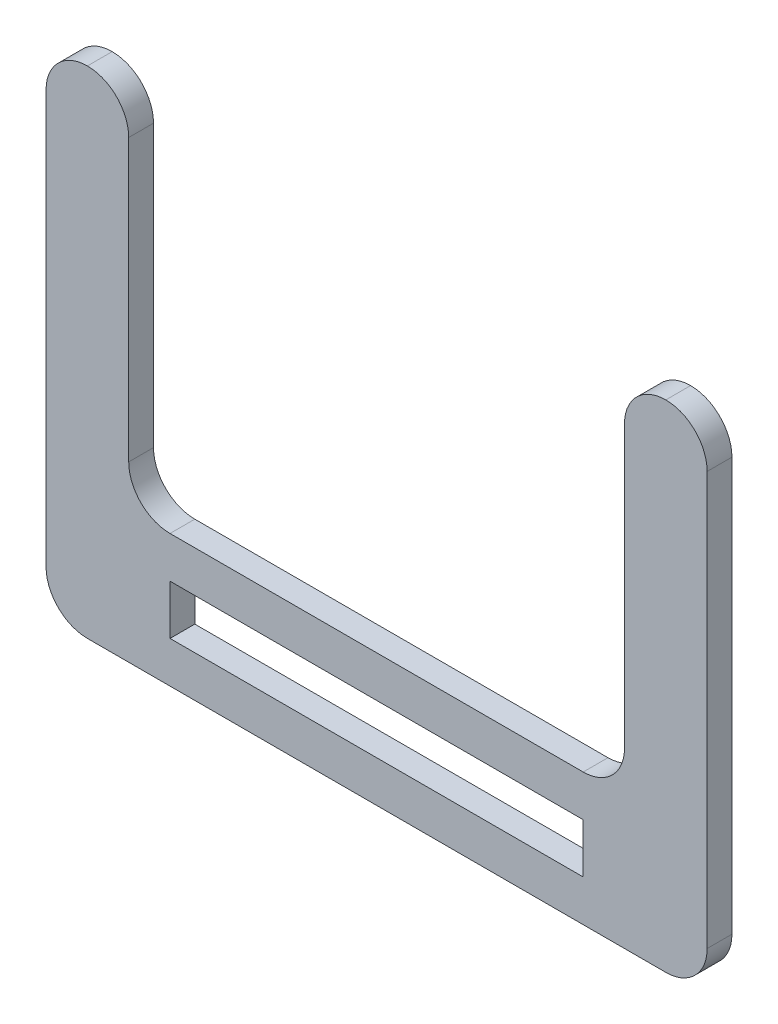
ISO-10303-21;
HEADER;
FILE_DESCRIPTION(('STEP AP214'),'2;1');
FILE_NAME('part.step','',(''),(''),'','','');
FILE_SCHEMA(('AUTOMOTIVE_DESIGN { 1 0 10303 214 1 1 1 1 }'));
ENDSEC;
DATA;
#1=APPLICATION_CONTEXT('core data for automotive mechanical design processes');
#2=APPLICATION_PROTOCOL_DEFINITION('international standard','automotive_design',2000,#1);
#3=PRODUCT_CONTEXT('',#1,'mechanical');
#4=PRODUCT('Part','Part','',(#3));
#5=PRODUCT_RELATED_PRODUCT_CATEGORY('part','',(#4));
#6=PRODUCT_DEFINITION_FORMATION('','',#4);
#7=PRODUCT_DEFINITION_CONTEXT('part definition',#1,'design');
#8=PRODUCT_DEFINITION('design','',#6,#7);
#9=PRODUCT_DEFINITION_SHAPE('','',#8);
#10=(LENGTH_UNIT() NAMED_UNIT(*) SI_UNIT(.MILLI.,.METRE.));
#11=(NAMED_UNIT(*) PLANE_ANGLE_UNIT() SI_UNIT($,.RADIAN.));
#12=(NAMED_UNIT(*) SI_UNIT($,.STERADIAN.) SOLID_ANGLE_UNIT());
#13=UNCERTAINTY_MEASURE_WITH_UNIT(LENGTH_MEASURE(1.E-05),#10,'distance_accuracy_value','');
#14=(GEOMETRIC_REPRESENTATION_CONTEXT(3) GLOBAL_UNCERTAINTY_ASSIGNED_CONTEXT((#13)) GLOBAL_UNIT_ASSIGNED_CONTEXT((#10,
#11,#12)) REPRESENTATION_CONTEXT('',''));
#15=CARTESIAN_POINT('',(0.,0.,0.));
#16=DIRECTION('',(0.,0.,1.));
#17=DIRECTION('',(1.,0.,0.));
#18=AXIS2_PLACEMENT_3D('',#15,#16,#17);
#19=CARTESIAN_POINT('',(-63.8455105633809,-4.50457746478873,2.99999999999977));
#20=DIRECTION('',(1.00000000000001,0.,0.));
#21=DIRECTION('',(0.,1.,0.));
#22=AXIS2_PLACEMENT_3D('',#19,#20,#21);
#23=PLANE('',#22);
#24=DIRECTION('',(0.,-1.,0.));
#25=VECTOR('',#24,1.);
#26=CARTESIAN_POINT('',(-63.8455105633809,-4.50457746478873,2.99999999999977));
#27=LINE('',#26,#25);
#28=CARTESIAN_POINT('',(-63.8455105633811,50.4954225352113,2.99999999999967));
#29=VERTEX_POINT('',#28);
#30=CARTESIAN_POINT('',(-63.8455105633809,0.495422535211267,2.99999999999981));
#31=VERTEX_POINT('',#30);
#32=EDGE_CURVE('E202',#29,#31,#27,.T.);
#33=ORIENTED_EDGE('',*,*,#32,.F.);
#34=DIRECTION('',(0.,0.,-1.00000000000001));
#35=VECTOR('',#34,1.);
#36=CARTESIAN_POINT('',(-63.8455105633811,50.4954225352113,2.99999999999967));
#37=LINE('',#36,#35);
#38=CARTESIAN_POINT('',(-63.8455105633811,50.4954225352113,-2.08166817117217E-13));
#39=VERTEX_POINT('',#38);
#40=EDGE_CURVE('E270',#29,#39,#37,.T.);
#41=ORIENTED_EDGE('',*,*,#40,.T.);
#42=DIRECTION('',(0.,-1.,0.));
#43=VECTOR('',#42,1.);
#44=CARTESIAN_POINT('',(-63.8455105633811,-4.50457746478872,-2.35922392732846E-13));
#45=LINE('',#44,#43);
#46=CARTESIAN_POINT('',(-63.8455105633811,0.495422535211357,0.));
#47=VERTEX_POINT('',#46);
#48=EDGE_CURVE('E182',#39,#47,#45,.T.);
#49=ORIENTED_EDGE('',*,*,#48,.T.);
#50=DIRECTION('',(0.,0.,-1.00000000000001));
#51=VECTOR('',#50,1.);
#52=CARTESIAN_POINT('',(-63.8455105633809,0.495422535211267,2.99999999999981));
#53=LINE('',#52,#51);
#54=EDGE_CURVE('E268',#47,#31,#53,.F.);
#55=ORIENTED_EDGE('',*,*,#54,.T.);
#56=EDGE_LOOP('',(#33,#41,#49,#55));
#57=FACE_BOUND('',#56,.T.);
#58=ADVANCED_FACE('F28',(#57),#23,.F.);
#59=CARTESIAN_POINT('',(-63.8455105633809,-4.50457746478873,2.99999999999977));
#60=DIRECTION('',(0.,1.,0.));
#61=DIRECTION('',(0.,0.,1.00000000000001));
#62=AXIS2_PLACEMENT_3D('',#59,#60,#61);
#63=PLANE('',#62);
#64=DIRECTION('',(1.00000000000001,0.,0.));
#65=VECTOR('',#64,1.);
#66=CARTESIAN_POINT('',(-63.8455105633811,-4.50457746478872,-2.35922392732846E-13));
#67=LINE('',#66,#65);
#68=CARTESIAN_POINT('',(-58.8455105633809,-4.50457746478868,-1.94289029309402E-13));
#69=VERTEX_POINT('',#68);
#70=CARTESIAN_POINT('',(11.1544894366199,-4.50457746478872,-1.66533453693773E-13));
#71=VERTEX_POINT('',#70);
#72=EDGE_CURVE('E187',#69,#71,#67,.T.);
#73=ORIENTED_EDGE('',*,*,#72,.T.);
#74=DIRECTION('',(0.,0.,-1.00000000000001));
#75=VECTOR('',#74,1.);
#76=CARTESIAN_POINT('',(11.1544894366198,-4.50457746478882,2.99999999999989));
#77=LINE('',#76,#75);
#78=CARTESIAN_POINT('',(11.1544894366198,-4.50457746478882,2.99999999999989));
#79=VERTEX_POINT('',#78);
#80=EDGE_CURVE('E275',#71,#79,#77,.F.);
#81=ORIENTED_EDGE('',*,*,#80,.T.);
#82=DIRECTION('',(1.00000000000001,0.,0.));
#83=VECTOR('',#82,1.);
#84=CARTESIAN_POINT('',(-63.8455105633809,-4.50457746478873,2.99999999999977));
#85=LINE('',#84,#83);
#86=CARTESIAN_POINT('',(-58.8455105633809,-4.50457746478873,2.9999999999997));
#87=VERTEX_POINT('',#86);
#88=EDGE_CURVE('E205',#87,#79,#85,.T.);
#89=ORIENTED_EDGE('',*,*,#88,.F.);
#90=DIRECTION('',(0.,0.,-1.00000000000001));
#91=VECTOR('',#90,1.);
#92=CARTESIAN_POINT('',(-58.8455105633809,-4.50457746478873,2.9999999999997));
#93=LINE('',#92,#91);
#94=EDGE_CURVE('E272',#87,#69,#93,.T.);
#95=ORIENTED_EDGE('',*,*,#94,.T.);
#96=EDGE_LOOP('',(#73,#81,#89,#95));
#97=FACE_BOUND('',#96,.T.);
#98=ADVANCED_FACE('F336',(#97),#63,.F.);
#99=CARTESIAN_POINT('',(16.1544894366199,55.4954225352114,2.99999999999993));
#100=DIRECTION('',(-1.00000000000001,0.,0.));
#101=DIRECTION('',(0.,-1.,0.));
#102=AXIS2_PLACEMENT_3D('',#99,#100,#101);
#103=PLANE('',#102);
#104=DIRECTION('',(0.,1.,0.));
#105=VECTOR('',#104,1.);
#106=CARTESIAN_POINT('',(16.1544894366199,55.4954225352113,0.));
#107=LINE('',#106,#105);
#108=CARTESIAN_POINT('',(16.15448943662,0.49542253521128,-1.2490009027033E-13));
#109=VERTEX_POINT('',#108);
#110=CARTESIAN_POINT('',(16.1544894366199,50.4954225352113,0.));
#111=VERTEX_POINT('',#110);
#112=EDGE_CURVE('E190',#109,#111,#107,.T.);
#113=ORIENTED_EDGE('',*,*,#112,.T.);
#114=DIRECTION('',(0.,0.,-1.00000000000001));
#115=VECTOR('',#114,1.);
#116=CARTESIAN_POINT('',(16.1544894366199,50.4954225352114,2.99999999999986));
#117=LINE('',#116,#115);
#118=CARTESIAN_POINT('',(16.1544894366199,50.4954225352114,2.99999999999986));
#119=VERTEX_POINT('',#118);
#120=EDGE_CURVE('E255',#111,#119,#117,.F.);
#121=ORIENTED_EDGE('',*,*,#120,.T.);
#122=DIRECTION('',(0.,1.,0.));
#123=VECTOR('',#122,1.);
#124=CARTESIAN_POINT('',(16.1544894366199,55.4954225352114,2.99999999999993));
#125=LINE('',#124,#123);
#126=CARTESIAN_POINT('',(16.15448943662,0.495422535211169,2.99999999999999));
#127=VERTEX_POINT('',#126);
#128=EDGE_CURVE('E208',#127,#119,#125,.T.);
#129=ORIENTED_EDGE('',*,*,#128,.F.);
#130=DIRECTION('',(0.,0.,-1.00000000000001));
#131=VECTOR('',#130,1.);
#132=CARTESIAN_POINT('',(16.15448943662,0.495422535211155,2.99999999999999));
#133=LINE('',#132,#131);
#134=EDGE_CURVE('E252',#127,#109,#133,.T.);
#135=ORIENTED_EDGE('',*,*,#134,.T.);
#136=EDGE_LOOP('',(#113,#121,#129,#135));
#137=FACE_BOUND('',#136,.T.);
#138=ADVANCED_FACE('F341',(#137),#103,.F.);
#139=CARTESIAN_POINT('',(6.15448943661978,11.4954225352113,2.99999999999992));
#140=DIRECTION('',(1.00000000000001,0.,0.));
#141=DIRECTION('',(0.,1.,0.));
#142=AXIS2_PLACEMENT_3D('',#139,#140,#141);
#143=PLANE('',#142);
#144=DIRECTION('',(0.,-1.,0.));
#145=VECTOR('',#144,1.);
#146=CARTESIAN_POINT('',(6.15448943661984,11.4954225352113,-2.35922392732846E-13));
#147=LINE('',#146,#145);
#148=CARTESIAN_POINT('',(6.15448943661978,50.4954225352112,-2.63677968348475E-13));
#149=VERTEX_POINT('',#148);
#150=CARTESIAN_POINT('',(6.15448943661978,16.4954225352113,-3.33066907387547E-13));
#151=VERTEX_POINT('',#150);
#152=EDGE_CURVE('E193',#149,#151,#147,.T.);
#153=ORIENTED_EDGE('',*,*,#152,.T.);
#154=DIRECTION('',(0.,0.,-1.00000000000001));
#155=VECTOR('',#154,1.);
#156=CARTESIAN_POINT('',(6.15448943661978,16.4954225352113,2.99999999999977));
#157=LINE('',#156,#155);
#158=CARTESIAN_POINT('',(6.15448943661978,16.4954225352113,2.99999999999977));
#159=VERTEX_POINT('',#158);
#160=EDGE_CURVE('E238',#151,#159,#157,.F.);
#161=ORIENTED_EDGE('',*,*,#160,.T.);
#162=DIRECTION('',(0.,-1.,0.));
#163=VECTOR('',#162,1.);
#164=CARTESIAN_POINT('',(6.15448943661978,11.4954225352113,2.99999999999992));
#165=LINE('',#164,#163);
#166=CARTESIAN_POINT('',(6.15448943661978,50.4954225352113,2.99999999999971));
#167=VERTEX_POINT('',#166);
#168=EDGE_CURVE('E210',#167,#159,#165,.T.);
#169=ORIENTED_EDGE('',*,*,#168,.F.);
#170=DIRECTION('',(0.,0.,-1.00000000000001));
#171=VECTOR('',#170,1.);
#172=CARTESIAN_POINT('',(6.15448943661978,50.4954225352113,2.99999999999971));
#173=LINE('',#172,#171);
#174=EDGE_CURVE('E236',#167,#149,#173,.T.);
#175=ORIENTED_EDGE('',*,*,#174,.T.);
#176=EDGE_LOOP('',(#153,#161,#169,#175));
#177=FACE_BOUND('',#176,.T.);
#178=ADVANCED_FACE('F289',(#177),#143,.F.);
#179=CARTESIAN_POINT('',(-53.8455105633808,11.4954225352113,2.99999999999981));
#180=DIRECTION('',(0.,-1.,0.));
#181=DIRECTION('',(1.00000000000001,0.,0.));
#182=AXIS2_PLACEMENT_3D('',#179,#180,#181);
#183=PLANE('',#182);
#184=DIRECTION('',(-1.00000000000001,0.,0.));
#185=VECTOR('',#184,1.);
#186=CARTESIAN_POINT('',(-53.8455105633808,11.4954225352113,-1.38777878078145E-13));
#187=LINE('',#186,#185);
#188=CARTESIAN_POINT('',(1.15448943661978,11.4954225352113,-2.08166817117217E-13));
#189=VERTEX_POINT('',#188);
#190=CARTESIAN_POINT('',(-48.8455105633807,11.4954225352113,-2.77555756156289E-13));
#191=VERTEX_POINT('',#190);
#192=EDGE_CURVE('E196',#189,#191,#187,.T.);
#193=ORIENTED_EDGE('',*,*,#192,.T.);
#194=DIRECTION('',(0.,0.,-1.00000000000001));
#195=VECTOR('',#194,1.);
#196=CARTESIAN_POINT('',(-48.8455105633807,11.4954225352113,2.99999999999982));
#197=LINE('',#196,#195);
#198=CARTESIAN_POINT('',(-48.8455105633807,11.4954225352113,2.99999999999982));
#199=VERTEX_POINT('',#198);
#200=EDGE_CURVE('E234',#191,#199,#197,.F.);
#201=ORIENTED_EDGE('',*,*,#200,.T.);
#202=DIRECTION('',(-1.00000000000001,0.,0.));
#203=VECTOR('',#202,1.);
#204=CARTESIAN_POINT('',(-53.8455105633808,11.4954225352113,2.99999999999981));
#205=LINE('',#204,#203);
#206=CARTESIAN_POINT('',(1.15448943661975,11.4954225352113,3.00000000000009));
#207=VERTEX_POINT('',#206);
#208=EDGE_CURVE('E213',#207,#199,#205,.T.);
#209=ORIENTED_EDGE('',*,*,#208,.F.);
#210=DIRECTION('',(0.,0.,-1.00000000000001));
#211=VECTOR('',#210,1.);
#212=CARTESIAN_POINT('',(1.15448943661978,11.4954225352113,-2.08166817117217E-13));
#213=LINE('',#212,#211);
#214=EDGE_CURVE('E231',#207,#189,#213,.T.);
#215=ORIENTED_EDGE('',*,*,#214,.T.);
#216=EDGE_LOOP('',(#193,#201,#209,#215));
#217=FACE_BOUND('',#216,.T.);
#218=ADVANCED_FACE('F297',(#217),#183,.F.);
#219=CARTESIAN_POINT('',(-53.8455105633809,55.4954225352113,2.99999999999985));
#220=DIRECTION('',(-1.00000000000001,0.,0.));
#221=DIRECTION('',(0.,-1.,0.));
#222=AXIS2_PLACEMENT_3D('',#219,#220,#221);
#223=PLANE('',#222);
#224=DIRECTION('',(0.,1.,0.));
#225=VECTOR('',#224,1.);
#226=CARTESIAN_POINT('',(-53.8455105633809,55.4954225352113,2.99999999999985));
#227=LINE('',#226,#225);
#228=CARTESIAN_POINT('',(-53.8455105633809,16.4954225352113,2.99999999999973));
#229=VERTEX_POINT('',#228);
#230=CARTESIAN_POINT('',(-53.8455105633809,50.4954225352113,2.99999999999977));
#231=VERTEX_POINT('',#230);
#232=EDGE_CURVE('E216',#229,#231,#227,.T.);
#233=ORIENTED_EDGE('',*,*,#232,.F.);
#234=DIRECTION('',(0.,0.,-1.00000000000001));
#235=VECTOR('',#234,1.);
#236=CARTESIAN_POINT('',(-53.8455105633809,16.4954225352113,-2.77555756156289E-13));
#237=LINE('',#236,#235);
#238=CARTESIAN_POINT('',(-53.8455105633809,16.4954225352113,-2.77555756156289E-13));
#239=VERTEX_POINT('',#238);
#240=EDGE_CURVE('E228',#229,#239,#237,.T.);
#241=ORIENTED_EDGE('',*,*,#240,.T.);
#242=DIRECTION('',(0.,1.,0.));
#243=VECTOR('',#242,1.);
#244=CARTESIAN_POINT('',(-53.845510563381,55.4954225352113,-1.80411241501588E-13));
#245=LINE('',#244,#243);
#246=CARTESIAN_POINT('',(-53.8455105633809,50.4954225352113,-3.19189119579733E-13));
#247=VERTEX_POINT('',#246);
#248=EDGE_CURVE('E199',#239,#247,#245,.T.);
#249=ORIENTED_EDGE('',*,*,#248,.T.);
#250=DIRECTION('',(0.,0.,-1.00000000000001));
#251=VECTOR('',#250,1.);
#252=CARTESIAN_POINT('',(-53.8455105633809,50.4954225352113,2.99999999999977));
#253=LINE('',#252,#251);
#254=EDGE_CURVE('E225',#247,#231,#253,.F.);
#255=ORIENTED_EDGE('',*,*,#254,.T.);
#256=EDGE_LOOP('',(#233,#241,#249,#255));
#257=FACE_BOUND('',#256,.T.);
#258=ADVANCED_FACE('F304',(#257),#223,.F.);
#259=CARTESIAN_POINT('',(-63.8455105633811,55.4954225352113,2.99999999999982));
#260=DIRECTION('',(0.,0.,-1.00000000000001));
#261=DIRECTION('',(-1.00000000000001,0.,0.));
#262=AXIS2_PLACEMENT_3D('',#259,#260,#261);
#263=PLANE('',#262);
#264=DIRECTION('',(1.00000000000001,0.,0.));
#265=VECTOR('',#264,1.);
#266=CARTESIAN_POINT('',(-48.8455105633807,0.495422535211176,2.99999999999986));
#267=LINE('',#266,#265);
#268=CARTESIAN_POINT('',(-48.8455105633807,0.495422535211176,2.99999999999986));
#269=VERTEX_POINT('',#268);
#270=CARTESIAN_POINT('',(1.1544894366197,0.495422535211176,3.00000000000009));
#271=VERTEX_POINT('',#270);
#272=EDGE_CURVE('E166',#269,#271,#267,.T.);
#273=ORIENTED_EDGE('',*,*,#272,.F.);
#274=DIRECTION('',(0.,-1.,0.));
#275=VECTOR('',#274,1.);
#276=CARTESIAN_POINT('',(-48.8455105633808,6.49542253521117,2.99999999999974));
#277=LINE('',#276,#275);
#278=CARTESIAN_POINT('',(-48.8455105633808,6.49542253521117,2.99999999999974));
#279=VERTEX_POINT('',#278);
#280=EDGE_CURVE('E171',#279,#269,#277,.T.);
#281=ORIENTED_EDGE('',*,*,#280,.F.);
#282=DIRECTION('',(-1.00000000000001,0.,0.));
#283=VECTOR('',#282,1.);
#284=CARTESIAN_POINT('',(-48.8455105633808,6.49542253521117,2.99999999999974));
#285=LINE('',#284,#283);
#286=CARTESIAN_POINT('',(1.15448943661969,6.49542253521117,2.99999999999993));
#287=VERTEX_POINT('',#286);
#288=EDGE_CURVE('E175',#287,#279,#285,.T.);
#289=ORIENTED_EDGE('',*,*,#288,.F.);
#290=DIRECTION('',(0.,1.,0.));
#291=VECTOR('',#290,1.);
#292=CARTESIAN_POINT('',(1.15448943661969,6.49542253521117,2.99999999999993));
#293=LINE('',#292,#291);
#294=EDGE_CURVE('E155',#271,#287,#293,.T.);
#295=ORIENTED_EDGE('',*,*,#294,.F.);
#296=EDGE_LOOP('',(#273,#281,#289,#295));
#297=FACE_BOUND('',#296,.T.);
#298=ORIENTED_EDGE('',*,*,#128,.T.);
#299=CARTESIAN_POINT('',(11.1544894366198,50.4954225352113,2.99999999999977));
#300=DIRECTION('',(0.,0.,-1.00000000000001));
#301=DIRECTION('',(-1.00000000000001,0.,0.));
#302=AXIS2_PLACEMENT_3D('',#299,#300,#301);
#303=CIRCLE('',#302,5.);
#304=CARTESIAN_POINT('',(11.1544894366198,55.4954225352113,2.99999999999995));
#305=VERTEX_POINT('',#304);
#306=EDGE_CURVE('E49',#119,#305,#303,.F.);
#307=ORIENTED_EDGE('',*,*,#306,.T.);
#308=CARTESIAN_POINT('',(11.1544894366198,50.4954225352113,2.99999999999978));
#309=DIRECTION('',(0.,0.,-1.00000000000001));
#310=DIRECTION('',(-1.00000000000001,0.,0.));
#311=AXIS2_PLACEMENT_3D('',#308,#309,#310);
#312=CIRCLE('',#311,5.);
#313=EDGE_CURVE('E265',#305,#167,#312,.F.);
#314=ORIENTED_EDGE('',*,*,#313,.T.);
#315=ORIENTED_EDGE('',*,*,#168,.T.);
#316=CARTESIAN_POINT('',(1.15448943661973,16.4954225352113,2.99999999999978));
#317=DIRECTION('',(0.,0.,-1.00000000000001));
#318=DIRECTION('',(-1.00000000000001,0.,0.));
#319=AXIS2_PLACEMENT_3D('',#316,#317,#318);
#320=CIRCLE('',#319,5.);
#321=EDGE_CURVE('E11',#159,#207,#320,.T.);
#322=ORIENTED_EDGE('',*,*,#321,.T.);
#323=ORIENTED_EDGE('',*,*,#208,.T.);
#324=CARTESIAN_POINT('',(-48.8455105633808,16.4954225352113,2.99999999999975));
#325=DIRECTION('',(0.,0.,-1.00000000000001));
#326=DIRECTION('',(-1.00000000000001,0.,0.));
#327=AXIS2_PLACEMENT_3D('',#324,#325,#326);
#328=CIRCLE('',#327,5.);
#329=EDGE_CURVE('E279',#199,#229,#328,.T.);
#330=ORIENTED_EDGE('',*,*,#329,.T.);
#331=ORIENTED_EDGE('',*,*,#232,.T.);
#332=CARTESIAN_POINT('',(-58.8455105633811,50.4954225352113,2.99999999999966));
#333=DIRECTION('',(0.,0.,-1.00000000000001));
#334=DIRECTION('',(-1.00000000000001,0.,0.));
#335=AXIS2_PLACEMENT_3D('',#332,#333,#334);
#336=CIRCLE('',#335,5.);
#337=CARTESIAN_POINT('',(-58.8455105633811,55.4954225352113,2.99999999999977));
#338=VERTEX_POINT('',#337);
#339=EDGE_CURVE('E42',#231,#338,#336,.F.);
#340=ORIENTED_EDGE('',*,*,#339,.T.);
#341=CARTESIAN_POINT('',(-58.8455105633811,50.4954225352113,2.99999999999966));
#342=DIRECTION('',(0.,0.,-1.00000000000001));
#343=DIRECTION('',(-1.00000000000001,0.,0.));
#344=AXIS2_PLACEMENT_3D('',#341,#342,#343);
#345=CIRCLE('',#344,5.);
#346=EDGE_CURVE('E262',#338,#29,#345,.F.);
#347=ORIENTED_EDGE('',*,*,#346,.T.);
#348=ORIENTED_EDGE('',*,*,#32,.T.);
#349=CARTESIAN_POINT('',(-58.845510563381,0.495422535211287,2.99999999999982));
#350=DIRECTION('',(0.,0.,-1.00000000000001));
#351=DIRECTION('',(-1.00000000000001,0.,0.));
#352=AXIS2_PLACEMENT_3D('',#349,#350,#351);
#353=CIRCLE('',#352,5.);
#354=EDGE_CURVE('E258',#31,#87,#353,.F.);
#355=ORIENTED_EDGE('',*,*,#354,.T.);
#356=ORIENTED_EDGE('',*,*,#88,.T.);
#357=CARTESIAN_POINT('',(11.1544894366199,0.495422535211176,3.00000000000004));
#358=DIRECTION('',(0.,0.,-1.00000000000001));
#359=DIRECTION('',(-1.00000000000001,0.,0.));
#360=AXIS2_PLACEMENT_3D('',#357,#358,#359);
#361=CIRCLE('',#360,5.);
#362=EDGE_CURVE('E260',#79,#127,#361,.F.);
#363=ORIENTED_EDGE('',*,*,#362,.T.);
#364=EDGE_LOOP('',(#298,#307,#314,#315,#322,#323,#330,#331,#340,#347,#348,#355,#356,#363));
#365=FACE_BOUND('',#364,.T.);
#366=ADVANCED_FACE('F173',(#297,#365),#263,.F.);
#367=CARTESIAN_POINT('',(-63.8455105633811,55.4954225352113,-1.52655665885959E-13));
#368=DIRECTION('',(0.,0.,-1.00000000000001));
#369=DIRECTION('',(-1.00000000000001,0.,0.));
#370=AXIS2_PLACEMENT_3D('',#367,#368,#369);
#371=PLANE('',#370);
#372=DIRECTION('',(0.,1.,0.));
#373=VECTOR('',#372,1.);
#374=CARTESIAN_POINT('',(-48.8455105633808,55.4954225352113,-3.88578058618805E-13));
#375=LINE('',#374,#373);
#376=CARTESIAN_POINT('',(-48.8455105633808,0.495422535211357,-1.94289029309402E-13));
#377=VERTEX_POINT('',#376);
#378=CARTESIAN_POINT('',(-48.8455105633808,6.49542253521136,-3.88578058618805E-13));
#379=VERTEX_POINT('',#378);
#380=EDGE_CURVE('E223',#377,#379,#375,.T.);
#381=ORIENTED_EDGE('',*,*,#380,.F.);
#382=DIRECTION('',(-1.00000000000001,0.,0.));
#383=VECTOR('',#382,1.);
#384=CARTESIAN_POINT('',(-63.8455105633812,0.495422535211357,0.));
#385=LINE('',#384,#383);
#386=CARTESIAN_POINT('',(1.15448943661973,0.495422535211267,-2.35922392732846E-13));
#387=VERTEX_POINT('',#386);
#388=EDGE_CURVE('E218',#387,#377,#385,.T.);
#389=ORIENTED_EDGE('',*,*,#388,.F.);
#390=DIRECTION('',(0.,-1.,0.));
#391=VECTOR('',#390,1.);
#392=CARTESIAN_POINT('',(1.15448943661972,55.4954225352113,0.));
#393=LINE('',#392,#391);
#394=CARTESIAN_POINT('',(1.15448943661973,6.49542253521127,-3.33066907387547E-13));
#395=VERTEX_POINT('',#394);
#396=EDGE_CURVE('E158',#395,#387,#393,.T.);
#397=ORIENTED_EDGE('',*,*,#396,.F.);
#398=DIRECTION('',(1.00000000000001,0.,0.));
#399=VECTOR('',#398,1.);
#400=CARTESIAN_POINT('',(-63.8455105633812,6.49542253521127,-2.35922392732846E-13));
#401=LINE('',#400,#399);
#402=EDGE_CURVE('E221',#379,#395,#401,.T.);
#403=ORIENTED_EDGE('',*,*,#402,.F.);
#404=EDGE_LOOP('',(#381,#389,#397,#403));
#405=FACE_BOUND('',#404,.T.);
#406=CARTESIAN_POINT('',(11.1544894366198,50.4954225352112,0.));
#407=DIRECTION('',(0.,0.,-1.00000000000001));
#408=DIRECTION('',(-1.00000000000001,0.,0.));
#409=AXIS2_PLACEMENT_3D('',#406,#407,#408);
#410=CIRCLE('',#409,5.);
#411=CARTESIAN_POINT('',(11.1544894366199,55.4954225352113,0.));
#412=VERTEX_POINT('',#411);
#413=EDGE_CURVE('E248',#149,#412,#410,.T.);
#414=ORIENTED_EDGE('',*,*,#413,.T.);
#415=CARTESIAN_POINT('',(11.1544894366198,50.4954225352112,0.));
#416=DIRECTION('',(0.,0.,-1.00000000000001));
#417=DIRECTION('',(-1.00000000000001,0.,0.));
#418=AXIS2_PLACEMENT_3D('',#415,#416,#417);
#419=CIRCLE('',#418,5.);
#420=EDGE_CURVE('E250',#412,#111,#419,.T.);
#421=ORIENTED_EDGE('',*,*,#420,.T.);
#422=ORIENTED_EDGE('',*,*,#112,.F.);
#423=CARTESIAN_POINT('',(11.1544894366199,0.495422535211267,0.));
#424=DIRECTION('',(0.,0.,-1.00000000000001));
#425=DIRECTION('',(-1.00000000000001,0.,0.));
#426=AXIS2_PLACEMENT_3D('',#423,#424,#425);
#427=CIRCLE('',#426,5.);
#428=EDGE_CURVE('E242',#109,#71,#427,.T.);
#429=ORIENTED_EDGE('',*,*,#428,.T.);
#430=ORIENTED_EDGE('',*,*,#72,.F.);
#431=CARTESIAN_POINT('',(-58.8455105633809,0.495422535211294,-1.2490009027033E-13));
#432=DIRECTION('',(0.,0.,-1.00000000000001));
#433=DIRECTION('',(-1.00000000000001,0.,0.));
#434=AXIS2_PLACEMENT_3D('',#431,#432,#433);
#435=CIRCLE('',#434,5.);
#436=EDGE_CURVE('E240',#69,#47,#435,.T.);
#437=ORIENTED_EDGE('',*,*,#436,.T.);
#438=ORIENTED_EDGE('',*,*,#48,.F.);
#439=CARTESIAN_POINT('',(-58.845510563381,50.4954225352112,-2.4980018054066E-13));
#440=DIRECTION('',(0.,0.,-1.00000000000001));
#441=DIRECTION('',(-1.00000000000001,0.,0.));
#442=AXIS2_PLACEMENT_3D('',#439,#440,#441);
#443=CIRCLE('',#442,5.);
#444=CARTESIAN_POINT('',(-58.845510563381,55.4954225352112,-1.80411241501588E-13));
#445=VERTEX_POINT('',#444);
#446=EDGE_CURVE('E244',#39,#445,#443,.T.);
#447=ORIENTED_EDGE('',*,*,#446,.T.);
#448=CARTESIAN_POINT('',(-58.845510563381,50.4954225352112,-2.4980018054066E-13));
#449=DIRECTION('',(0.,0.,-1.00000000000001));
#450=DIRECTION('',(-1.00000000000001,0.,0.));
#451=AXIS2_PLACEMENT_3D('',#448,#449,#450);
#452=CIRCLE('',#451,5.);
#453=EDGE_CURVE('E246',#445,#247,#452,.T.);
#454=ORIENTED_EDGE('',*,*,#453,.T.);
#455=ORIENTED_EDGE('',*,*,#248,.F.);
#456=CARTESIAN_POINT('',(-48.8455105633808,16.4954225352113,-3.7470027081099E-13));
#457=DIRECTION('',(0.,0.,-1.00000000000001));
#458=DIRECTION('',(-1.00000000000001,0.,0.));
#459=AXIS2_PLACEMENT_3D('',#456,#457,#458);
#460=CIRCLE('',#459,5.);
#461=EDGE_CURVE('E277',#239,#191,#460,.F.);
#462=ORIENTED_EDGE('',*,*,#461,.T.);
#463=ORIENTED_EDGE('',*,*,#192,.F.);
#464=CARTESIAN_POINT('',(1.15448943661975,16.4954225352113,-3.05311331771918E-13));
#465=DIRECTION('',(0.,0.,-1.00000000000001));
#466=DIRECTION('',(-1.00000000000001,0.,0.));
#467=AXIS2_PLACEMENT_3D('',#464,#465,#466);
#468=CIRCLE('',#467,5.);
#469=EDGE_CURVE('E35',#189,#151,#468,.F.);
#470=ORIENTED_EDGE('',*,*,#469,.T.);
#471=ORIENTED_EDGE('',*,*,#152,.F.);
#472=EDGE_LOOP('',(#414,#421,#422,#429,#430,#437,#438,#447,#454,#455,#462,#463,#470,#471));
#473=FACE_BOUND('',#472,.T.);
#474=ADVANCED_FACE('F283',(#405,#473),#371,.T.);
#475=CARTESIAN_POINT('',(-48.8455105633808,6.49542253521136,-3.00000000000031));
#476=DIRECTION('',(-1.00000000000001,0.,0.));
#477=DIRECTION('',(0.,-1.,0.));
#478=AXIS2_PLACEMENT_3D('',#475,#476,#477);
#479=PLANE('',#478);
#480=ORIENTED_EDGE('',*,*,#380,.T.);
#481=DIRECTION('',(0.,0.,1.00000000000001));
#482=VECTOR('',#481,1.);
#483=CARTESIAN_POINT('',(-48.8455105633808,6.49542253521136,-3.00000000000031));
#484=LINE('',#483,#482);
#485=EDGE_CURVE('E180',#379,#279,#484,.T.);
#486=ORIENTED_EDGE('',*,*,#485,.T.);
#487=ORIENTED_EDGE('',*,*,#280,.T.);
#488=DIRECTION('',(0.,0.,1.00000000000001));
#489=VECTOR('',#488,1.);
#490=CARTESIAN_POINT('',(-48.8455105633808,0.495422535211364,-3.00000000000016));
#491=LINE('',#490,#489);
#492=EDGE_CURVE('E162',#377,#269,#491,.T.);
#493=ORIENTED_EDGE('',*,*,#492,.F.);
#494=EDGE_LOOP('',(#480,#486,#487,#493));
#495=FACE_BOUND('',#494,.T.);
#496=ADVANCED_FACE('F320',(#495),#479,.F.);
#497=CARTESIAN_POINT('',(-48.8455105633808,6.49542253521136,-3.00000000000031));
#498=DIRECTION('',(0.,1.,0.));
#499=DIRECTION('',(0.,0.,1.00000000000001));
#500=AXIS2_PLACEMENT_3D('',#497,#498,#499);
#501=PLANE('',#500);
#502=ORIENTED_EDGE('',*,*,#402,.T.);
#503=DIRECTION('',(0.,0.,1.00000000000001));
#504=VECTOR('',#503,1.);
#505=CARTESIAN_POINT('',(1.15448943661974,6.49542253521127,-3.00000000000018));
#506=LINE('',#505,#504);
#507=EDGE_CURVE('E161',#395,#287,#506,.T.);
#508=ORIENTED_EDGE('',*,*,#507,.T.);
#509=ORIENTED_EDGE('',*,*,#288,.T.);
#510=ORIENTED_EDGE('',*,*,#485,.F.);
#511=EDGE_LOOP('',(#502,#508,#509,#510));
#512=FACE_BOUND('',#511,.T.);
#513=ADVANCED_FACE('F325',(#512),#501,.F.);
#514=CARTESIAN_POINT('',(1.15448943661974,6.49542253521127,-3.00000000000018));
#515=DIRECTION('',(1.00000000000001,0.,0.));
#516=DIRECTION('',(0.,1.,0.));
#517=AXIS2_PLACEMENT_3D('',#514,#515,#516);
#518=PLANE('',#517);
#519=ORIENTED_EDGE('',*,*,#396,.T.);
#520=DIRECTION('',(0.,0.,1.00000000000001));
#521=VECTOR('',#520,1.);
#522=CARTESIAN_POINT('',(1.15448943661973,0.495422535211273,-3.00000000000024));
#523=LINE('',#522,#521);
#524=EDGE_CURVE('E150',#387,#271,#523,.T.);
#525=ORIENTED_EDGE('',*,*,#524,.T.);
#526=ORIENTED_EDGE('',*,*,#294,.T.);
#527=ORIENTED_EDGE('',*,*,#507,.F.);
#528=EDGE_LOOP('',(#519,#525,#526,#527));
#529=FACE_BOUND('',#528,.T.);
#530=ADVANCED_FACE('F152',(#529),#518,.F.);
#531=CARTESIAN_POINT('',(-48.8455105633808,0.495422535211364,-3.00000000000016));
#532=DIRECTION('',(0.,-1.,0.));
#533=DIRECTION('',(0.,0.,-1.00000000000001));
#534=AXIS2_PLACEMENT_3D('',#531,#532,#533);
#535=PLANE('',#534);
#536=ORIENTED_EDGE('',*,*,#388,.T.);
#537=ORIENTED_EDGE('',*,*,#492,.T.);
#538=ORIENTED_EDGE('',*,*,#272,.T.);
#539=ORIENTED_EDGE('',*,*,#524,.F.);
#540=EDGE_LOOP('',(#536,#537,#538,#539));
#541=FACE_BOUND('',#540,.T.);
#542=ADVANCED_FACE('F167',(#541),#535,.F.);
#543=CARTESIAN_POINT('',(-48.8455105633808,16.4954225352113,2.99999999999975));
#544=DIRECTION('',(0.,0.,1.00000000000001));
#545=DIRECTION('',(1.00000000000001,0.,0.));
#546=AXIS2_PLACEMENT_3D('',#543,#544,#545);
#547=CYLINDRICAL_SURFACE('',#546,5.);
#548=ORIENTED_EDGE('',*,*,#329,.F.);
#549=ORIENTED_EDGE('',*,*,#200,.F.);
#550=ORIENTED_EDGE('',*,*,#461,.F.);
#551=ORIENTED_EDGE('',*,*,#240,.F.);
#552=EDGE_LOOP('',(#548,#549,#550,#551));
#553=FACE_BOUND('',#552,.T.);
#554=ADVANCED_FACE('F300',(#553),#547,.F.);
#555=CARTESIAN_POINT('',(1.15448943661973,16.4954225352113,2.99999999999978));
#556=DIRECTION('',(0.,0.,1.00000000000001));
#557=DIRECTION('',(1.00000000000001,0.,0.));
#558=AXIS2_PLACEMENT_3D('',#555,#556,#557);
#559=CYLINDRICAL_SURFACE('',#558,5.);
#560=ORIENTED_EDGE('',*,*,#321,.F.);
#561=ORIENTED_EDGE('',*,*,#160,.F.);
#562=ORIENTED_EDGE('',*,*,#469,.F.);
#563=ORIENTED_EDGE('',*,*,#214,.F.);
#564=EDGE_LOOP('',(#560,#561,#562,#563));
#565=FACE_BOUND('',#564,.T.);
#566=ADVANCED_FACE('F293',(#565),#559,.F.);
#567=CARTESIAN_POINT('',(11.1544894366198,50.4954225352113,2.99999999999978));
#568=DIRECTION('',(0.,0.,-1.00000000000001));
#569=DIRECTION('',(-1.00000000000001,0.,0.));
#570=AXIS2_PLACEMENT_3D('',#567,#568,#569);
#571=CYLINDRICAL_SURFACE('',#570,5.);
#572=ORIENTED_EDGE('',*,*,#174,.F.);
#573=ORIENTED_EDGE('',*,*,#313,.F.);
#574=DIRECTION('',(0.,0.,-1.00000000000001));
#575=VECTOR('',#574,1.);
#576=CARTESIAN_POINT('',(11.1544894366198,55.4954225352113,2.99999999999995));
#577=LINE('',#576,#575);
#578=EDGE_CURVE('E315',#412,#305,#577,.F.);
#579=ORIENTED_EDGE('',*,*,#578,.F.);
#580=ORIENTED_EDGE('',*,*,#413,.F.);
#581=EDGE_LOOP('',(#572,#573,#579,#580));
#582=FACE_BOUND('',#581,.T.);
#583=ADVANCED_FACE('F368',(#582),#571,.T.);
#584=CARTESIAN_POINT('',(11.1544894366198,50.4954225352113,2.99999999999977));
#585=DIRECTION('',(0.,0.,-1.00000000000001));
#586=DIRECTION('',(-1.00000000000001,0.,0.));
#587=AXIS2_PLACEMENT_3D('',#584,#585,#586);
#588=CYLINDRICAL_SURFACE('',#587,5.);
#589=ORIENTED_EDGE('',*,*,#306,.F.);
#590=ORIENTED_EDGE('',*,*,#120,.F.);
#591=ORIENTED_EDGE('',*,*,#420,.F.);
#592=ORIENTED_EDGE('',*,*,#578,.T.);
#593=EDGE_LOOP('',(#589,#590,#591,#592));
#594=FACE_BOUND('',#593,.T.);
#595=ADVANCED_FACE('F365',(#594),#588,.T.);
#596=CARTESIAN_POINT('',(-58.8455105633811,50.4954225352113,2.99999999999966));
#597=DIRECTION('',(0.,0.,-1.00000000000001));
#598=DIRECTION('',(-1.00000000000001,0.,0.));
#599=AXIS2_PLACEMENT_3D('',#596,#597,#598);
#600=CYLINDRICAL_SURFACE('',#599,5.);
#601=ORIENTED_EDGE('',*,*,#40,.F.);
#602=ORIENTED_EDGE('',*,*,#346,.F.);
#603=DIRECTION('',(0.,0.,-1.00000000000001));
#604=VECTOR('',#603,1.);
#605=CARTESIAN_POINT('',(-58.8455105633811,55.4954225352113,2.99999999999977));
#606=LINE('',#605,#604);
#607=EDGE_CURVE('E312',#445,#338,#606,.F.);
#608=ORIENTED_EDGE('',*,*,#607,.F.);
#609=ORIENTED_EDGE('',*,*,#446,.F.);
#610=EDGE_LOOP('',(#601,#602,#608,#609));
#611=FACE_BOUND('',#610,.T.);
#612=ADVANCED_FACE('F348',(#611),#600,.T.);
#613=CARTESIAN_POINT('',(-58.8455105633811,50.4954225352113,2.99999999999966));
#614=DIRECTION('',(0.,0.,-1.00000000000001));
#615=DIRECTION('',(-1.00000000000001,0.,0.));
#616=AXIS2_PLACEMENT_3D('',#613,#614,#615);
#617=CYLINDRICAL_SURFACE('',#616,5.);
#618=ORIENTED_EDGE('',*,*,#339,.F.);
#619=ORIENTED_EDGE('',*,*,#254,.F.);
#620=ORIENTED_EDGE('',*,*,#453,.F.);
#621=ORIENTED_EDGE('',*,*,#607,.T.);
#622=EDGE_LOOP('',(#618,#619,#620,#621));
#623=FACE_BOUND('',#622,.T.);
#624=ADVANCED_FACE('F309',(#623),#617,.T.);
#625=CARTESIAN_POINT('',(11.1544894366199,0.495422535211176,3.00000000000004));
#626=DIRECTION('',(0.,0.,-1.00000000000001));
#627=DIRECTION('',(-1.00000000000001,0.,0.));
#628=AXIS2_PLACEMENT_3D('',#625,#626,#627);
#629=CYLINDRICAL_SURFACE('',#628,5.);
#630=ORIENTED_EDGE('',*,*,#362,.F.);
#631=ORIENTED_EDGE('',*,*,#80,.F.);
#632=ORIENTED_EDGE('',*,*,#428,.F.);
#633=ORIENTED_EDGE('',*,*,#134,.F.);
#634=EDGE_LOOP('',(#630,#631,#632,#633));
#635=FACE_BOUND('',#634,.T.);
#636=ADVANCED_FACE('F357',(#635),#629,.T.);
#637=CARTESIAN_POINT('',(-58.845510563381,0.495422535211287,2.99999999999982));
#638=DIRECTION('',(0.,0.,-1.00000000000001));
#639=DIRECTION('',(-1.00000000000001,0.,0.));
#640=AXIS2_PLACEMENT_3D('',#637,#638,#639);
#641=CYLINDRICAL_SURFACE('',#640,5.);
#642=ORIENTED_EDGE('',*,*,#354,.F.);
#643=ORIENTED_EDGE('',*,*,#54,.F.);
#644=ORIENTED_EDGE('',*,*,#436,.F.);
#645=ORIENTED_EDGE('',*,*,#94,.F.);
#646=EDGE_LOOP('',(#642,#643,#644,#645));
#647=FACE_BOUND('',#646,.T.);
#648=ADVANCED_FACE('F351',(#647),#641,.T.);
#649=CLOSED_SHELL('',(#58,#98,#138,#178,#218,#258,#366,#474,#496,#513,#530,#542,#554,#566,#583,
#595,#612,#624,#636,#648));
#650=MANIFOLD_SOLID_BREP('B2',#649);
#651=ADVANCED_BREP_SHAPE_REPRESENTATION('',(#18,#650),#14);
#652=SHAPE_DEFINITION_REPRESENTATION(#9,#651);
ENDSEC;
END-ISO-10303-21;
